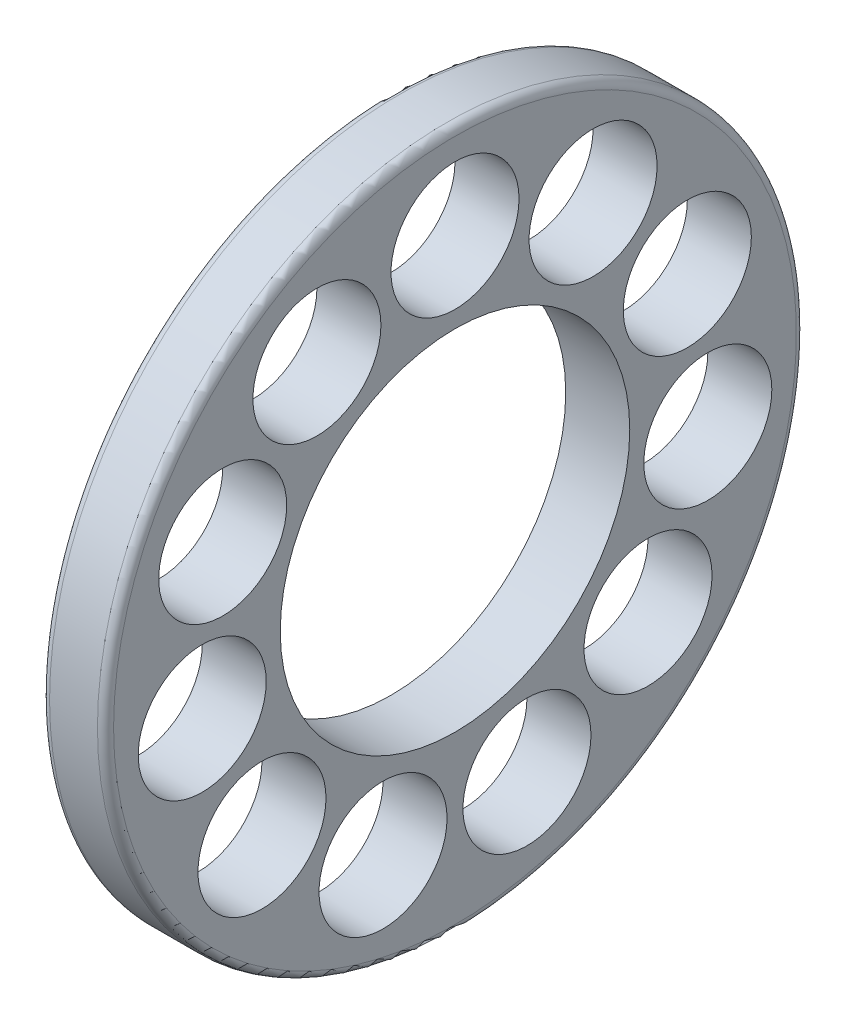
ISO-10303-21;
HEADER;
FILE_DESCRIPTION(('STEP AP214'),'2;1');
FILE_NAME('part.step','',(''),(''),'','','');
FILE_SCHEMA(('AUTOMOTIVE_DESIGN { 1 0 10303 214 1 1 1 1 }'));
ENDSEC;
DATA;
#1=APPLICATION_CONTEXT('core data for automotive mechanical design processes');
#2=APPLICATION_PROTOCOL_DEFINITION('international standard','automotive_design',2000,#1);
#3=PRODUCT_CONTEXT('',#1,'mechanical');
#4=PRODUCT('Part','Part','',(#3));
#5=PRODUCT_RELATED_PRODUCT_CATEGORY('part','',(#4));
#6=PRODUCT_DEFINITION_FORMATION('','',#4);
#7=PRODUCT_DEFINITION_CONTEXT('part definition',#1,'design');
#8=PRODUCT_DEFINITION('design','',#6,#7);
#9=PRODUCT_DEFINITION_SHAPE('','',#8);
#10=(LENGTH_UNIT() NAMED_UNIT(*) SI_UNIT(.MILLI.,.METRE.));
#11=(NAMED_UNIT(*) PLANE_ANGLE_UNIT() SI_UNIT($,.RADIAN.));
#12=(NAMED_UNIT(*) SI_UNIT($,.STERADIAN.) SOLID_ANGLE_UNIT());
#13=UNCERTAINTY_MEASURE_WITH_UNIT(LENGTH_MEASURE(1.E-05),#10,'distance_accuracy_value','');
#14=(GEOMETRIC_REPRESENTATION_CONTEXT(3) GLOBAL_UNCERTAINTY_ASSIGNED_CONTEXT((#13)) GLOBAL_UNIT_ASSIGNED_CONTEXT((#10,
#11,#12)) REPRESENTATION_CONTEXT('',''));
#15=CARTESIAN_POINT('',(0.,0.,0.));
#16=DIRECTION('',(0.,0.,1.));
#17=DIRECTION('',(1.,0.,0.));
#18=AXIS2_PLACEMENT_3D('',#15,#16,#17);
#19=CARTESIAN_POINT('',(3.3095,-12.9359195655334,-12.7));
#20=DIRECTION('',(-1.,0.,0.));
#21=DIRECTION('',(0.,0.,1.));
#22=AXIS2_PLACEMENT_3D('',#19,#20,#21);
#23=PLANE('',#22);
#24=CARTESIAN_POINT('',(3.3095,0.,0.));
#25=DIRECTION('',(-1.,0.,0.));
#26=DIRECTION('',(0.,0.,-1.));
#27=AXIS2_PLACEMENT_3D('',#24,#25,#26);
#28=CIRCLE('',#27,12.7);
#29=CARTESIAN_POINT('',(3.3095,0.,-12.7));
#30=VERTEX_POINT('',#29);
#31=EDGE_CURVE('E103',#30,#30,#28,.F.);
#32=ORIENTED_EDGE('',*,*,#31,.F.);
#33=EDGE_LOOP('',(#32));
#34=FACE_BOUND('',#33,.T.);
#35=CARTESIAN_POINT('',(3.3095,0.,0.));
#36=DIRECTION('',(1.,0.,0.));
#37=DIRECTION('',(0.,0.,1.));
#38=AXIS2_PLACEMENT_3D('',#35,#36,#37);
#39=CIRCLE('',#38,6.5);
#40=CARTESIAN_POINT('',(3.3095,0.,6.5));
#41=VERTEX_POINT('',#40);
#42=EDGE_CURVE('E100',#41,#41,#39,.T.);
#43=ORIENTED_EDGE('',*,*,#42,.T.);
#44=EDGE_LOOP('',(#43));
#45=FACE_BOUND('',#44,.T.);
#46=CARTESIAN_POINT('',(3.3095,3.9464426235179,8.6415039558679));
#47=DIRECTION('',(1.,0.,0.));
#48=DIRECTION('',(0.,0.,1.));
#49=AXIS2_PLACEMENT_3D('',#46,#47,#48);
#50=CIRCLE('',#49,2.381);
#51=CARTESIAN_POINT('',(3.3095,3.9464426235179,11.0225039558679));
#52=VERTEX_POINT('',#51);
#53=EDGE_CURVE('E97',#52,#52,#50,.T.);
#54=ORIENTED_EDGE('',*,*,#53,.T.);
#55=EDGE_LOOP('',(#54));
#56=FACE_BOUND('',#55,.T.);
#57=CARTESIAN_POINT('',(3.3095,-1.3519909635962,9.4033036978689));
#58=DIRECTION('',(1.,0.,0.));
#59=DIRECTION('',(0.,0.,1.));
#60=AXIS2_PLACEMENT_3D('',#57,#58,#59);
#61=CIRCLE('',#60,2.381);
#62=CARTESIAN_POINT('',(3.3095,-1.3519909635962,11.7843036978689));
#63=VERTEX_POINT('',#62);
#64=EDGE_CURVE('E94',#63,#63,#61,.T.);
#65=ORIENTED_EDGE('',*,*,#64,.T.);
#66=EDGE_LOOP('',(#65));
#67=FACE_BOUND('',#66,.T.);
#68=CARTESIAN_POINT('',(3.3095,-9.1151832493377,2.6764592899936));
#69=DIRECTION('',(1.,0.,0.));
#70=DIRECTION('',(0.,0.,1.));
#71=AXIS2_PLACEMENT_3D('',#68,#69,#70);
#72=CIRCLE('',#71,2.381);
#73=CARTESIAN_POINT('',(3.3095,-9.1151832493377,5.0574592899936));
#74=VERTEX_POINT('',#73);
#75=EDGE_CURVE('E91',#74,#74,#72,.T.);
#76=ORIENTED_EDGE('',*,*,#75,.T.);
#77=EDGE_LOOP('',(#76));
#78=FACE_BOUND('',#77,.T.);
#79=CARTESIAN_POINT('',(3.3095,-6.2211769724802,7.1796209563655));
#80=DIRECTION('',(1.,0.,0.));
#81=DIRECTION('',(0.,0.,1.));
#82=AXIS2_PLACEMENT_3D('',#79,#80,#81);
#83=CIRCLE('',#82,2.381);
#84=CARTESIAN_POINT('',(3.3095,-6.2211769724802,9.5606209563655));
#85=VERTEX_POINT('',#84);
#86=EDGE_CURVE('E88',#85,#85,#83,.T.);
#87=ORIENTED_EDGE('',*,*,#86,.T.);
#88=EDGE_LOOP('',(#87));
#89=FACE_BOUND('',#88,.T.);
#90=CARTESIAN_POINT('',(3.3095,-6.2211769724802,-7.1796209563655));
#91=DIRECTION('',(1.,0.,0.));
#92=DIRECTION('',(0.,0.,1.));
#93=AXIS2_PLACEMENT_3D('',#90,#91,#92);
#94=CIRCLE('',#93,2.381);
#95=CARTESIAN_POINT('',(3.3095,-6.2211769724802,-4.7986209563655));
#96=VERTEX_POINT('',#95);
#97=EDGE_CURVE('E85',#96,#96,#94,.T.);
#98=ORIENTED_EDGE('',*,*,#97,.T.);
#99=EDGE_LOOP('',(#98));
#100=FACE_BOUND('',#99,.T.);
#101=CARTESIAN_POINT('',(3.3095,-9.1151832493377,-2.6764592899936));
#102=DIRECTION('',(1.,0.,0.));
#103=DIRECTION('',(0.,0.,1.));
#104=AXIS2_PLACEMENT_3D('',#101,#102,#103);
#105=CIRCLE('',#104,2.381);
#106=CARTESIAN_POINT('',(3.3095,-9.1151832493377,-0.2954592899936));
#107=VERTEX_POINT('',#106);
#108=EDGE_CURVE('E82',#107,#107,#105,.T.);
#109=ORIENTED_EDGE('',*,*,#108,.T.);
#110=EDGE_LOOP('',(#109));
#111=FACE_BOUND('',#110,.T.);
#112=CARTESIAN_POINT('',(3.3095,-1.3519909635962,-9.4033036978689));
#113=DIRECTION('',(1.,0.,0.));
#114=DIRECTION('',(0.,0.,1.));
#115=AXIS2_PLACEMENT_3D('',#112,#113,#114);
#116=CIRCLE('',#115,2.381);
#117=CARTESIAN_POINT('',(3.3095,-1.3519909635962,-7.0223036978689));
#118=VERTEX_POINT('',#117);
#119=EDGE_CURVE('E79',#118,#118,#116,.T.);
#120=ORIENTED_EDGE('',*,*,#119,.T.);
#121=EDGE_LOOP('',(#120));
#122=FACE_BOUND('',#121,.T.);
#123=CARTESIAN_POINT('',(3.3095,3.9464426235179,-8.6415039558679));
#124=DIRECTION('',(1.,0.,0.));
#125=DIRECTION('',(0.,0.,1.));
#126=AXIS2_PLACEMENT_3D('',#123,#124,#125);
#127=CIRCLE('',#126,2.381);
#128=CARTESIAN_POINT('',(3.3095,3.9464426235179,-6.2605039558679));
#129=VERTEX_POINT('',#128);
#130=EDGE_CURVE('E76',#129,#129,#127,.T.);
#131=ORIENTED_EDGE('',*,*,#130,.T.);
#132=EDGE_LOOP('',(#131));
#133=FACE_BOUND('',#132,.T.);
#134=CARTESIAN_POINT('',(3.3095,7.9919085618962,-5.1360877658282));
#135=DIRECTION('',(1.,0.,0.));
#136=DIRECTION('',(0.,0.,1.));
#137=AXIS2_PLACEMENT_3D('',#134,#135,#136);
#138=CIRCLE('',#137,2.381);
#139=CARTESIAN_POINT('',(3.3095,7.9919085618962,-2.7550877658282));
#140=VERTEX_POINT('',#139);
#141=EDGE_CURVE('E73',#140,#140,#138,.T.);
#142=ORIENTED_EDGE('',*,*,#141,.T.);
#143=EDGE_LOOP('',(#142));
#144=FACE_BOUND('',#143,.T.);
#145=CARTESIAN_POINT('',(3.3095,7.9919085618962,5.1360877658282));
#146=DIRECTION('',(1.,0.,0.));
#147=DIRECTION('',(0.,0.,1.));
#148=AXIS2_PLACEMENT_3D('',#145,#146,#147);
#149=CIRCLE('',#148,2.381);
#150=CARTESIAN_POINT('',(3.3095,7.9919085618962,7.5170877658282));
#151=VERTEX_POINT('',#150);
#152=EDGE_CURVE('E70',#151,#151,#149,.T.);
#153=ORIENTED_EDGE('',*,*,#152,.T.);
#154=EDGE_LOOP('',(#153));
#155=FACE_BOUND('',#154,.T.);
#156=CARTESIAN_POINT('',(3.3095,9.5,0.));
#157=DIRECTION('',(1.,0.,0.));
#158=DIRECTION('',(0.,0.,1.));
#159=AXIS2_PLACEMENT_3D('',#156,#157,#158);
#160=CIRCLE('',#159,2.381);
#161=CARTESIAN_POINT('',(3.3095,9.5,2.381));
#162=VERTEX_POINT('',#161);
#163=EDGE_CURVE('E67',#162,#162,#160,.T.);
#164=ORIENTED_EDGE('',*,*,#163,.T.);
#165=EDGE_LOOP('',(#164));
#166=FACE_BOUND('',#165,.T.);
#167=ADVANCED_FACE('F14',(#34,#45,#56,#67,#78,#89,#100,#111,#122,#133,#144,#155,#166),#23,.T.);
#168=CARTESIAN_POINT('',(5.6905,-12.9359195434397,12.7));
#169=DIRECTION('',(1.,0.,0.));
#170=DIRECTION('',(0.,0.,-1.));
#171=AXIS2_PLACEMENT_3D('',#168,#169,#170);
#172=PLANE('',#171);
#173=CARTESIAN_POINT('',(5.6905,0.,0.));
#174=DIRECTION('',(1.,0.,0.));
#175=DIRECTION('',(0.,-1.168417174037E-09,1.));
#176=AXIS2_PLACEMENT_3D('',#173,#174,#175);
#177=CIRCLE('',#176,12.700000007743);
#178=CARTESIAN_POINT('',(5.6905,-1.48388981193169E-08,12.700000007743));
#179=VERTEX_POINT('',#178);
#180=EDGE_CURVE('E64',#179,#179,#177,.T.);
#181=ORIENTED_EDGE('',*,*,#180,.T.);
#182=EDGE_LOOP('',(#181));
#183=FACE_BOUND('',#182,.T.);
#184=CARTESIAN_POINT('',(5.6905,0.,0.));
#185=DIRECTION('',(-1.,0.,0.));
#186=DIRECTION('',(0.,0.,-1.));
#187=AXIS2_PLACEMENT_3D('',#184,#185,#186);
#188=CIRCLE('',#187,6.5);
#189=CARTESIAN_POINT('',(5.6905,0.,-6.5));
#190=VERTEX_POINT('',#189);
#191=EDGE_CURVE('E61',#190,#190,#188,.F.);
#192=ORIENTED_EDGE('',*,*,#191,.F.);
#193=EDGE_LOOP('',(#192));
#194=FACE_BOUND('',#193,.T.);
#195=CARTESIAN_POINT('',(5.6905,3.9464426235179,8.6415039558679));
#196=DIRECTION('',(-1.,0.,0.));
#197=DIRECTION('',(0.,0.,-1.));
#198=AXIS2_PLACEMENT_3D('',#195,#196,#197);
#199=CIRCLE('',#198,2.381);
#200=CARTESIAN_POINT('',(5.6905,3.9464426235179,6.2605039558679));
#201=VERTEX_POINT('',#200);
#202=EDGE_CURVE('E58',#201,#201,#199,.T.);
#203=ORIENTED_EDGE('',*,*,#202,.T.);
#204=EDGE_LOOP('',(#203));
#205=FACE_BOUND('',#204,.T.);
#206=CARTESIAN_POINT('',(5.6905,-1.3519909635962,9.4033036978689));
#207=DIRECTION('',(-1.,0.,0.));
#208=DIRECTION('',(0.,0.,-1.));
#209=AXIS2_PLACEMENT_3D('',#206,#207,#208);
#210=CIRCLE('',#209,2.381);
#211=CARTESIAN_POINT('',(5.6905,-1.3519909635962,7.0223036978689));
#212=VERTEX_POINT('',#211);
#213=EDGE_CURVE('E55',#212,#212,#210,.T.);
#214=ORIENTED_EDGE('',*,*,#213,.T.);
#215=EDGE_LOOP('',(#214));
#216=FACE_BOUND('',#215,.T.);
#217=CARTESIAN_POINT('',(5.6905,-9.1151832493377,2.6764592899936));
#218=DIRECTION('',(-1.,0.,0.));
#219=DIRECTION('',(0.,0.,-1.));
#220=AXIS2_PLACEMENT_3D('',#217,#218,#219);
#221=CIRCLE('',#220,2.381);
#222=CARTESIAN_POINT('',(5.6905,-9.1151832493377,0.2954592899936));
#223=VERTEX_POINT('',#222);
#224=EDGE_CURVE('E52',#223,#223,#221,.T.);
#225=ORIENTED_EDGE('',*,*,#224,.T.);
#226=EDGE_LOOP('',(#225));
#227=FACE_BOUND('',#226,.T.);
#228=CARTESIAN_POINT('',(5.6905,-6.2211769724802,7.1796209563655));
#229=DIRECTION('',(-1.,0.,0.));
#230=DIRECTION('',(0.,0.,-1.));
#231=AXIS2_PLACEMENT_3D('',#228,#229,#230);
#232=CIRCLE('',#231,2.381);
#233=CARTESIAN_POINT('',(5.6905,-6.2211769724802,4.7986209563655));
#234=VERTEX_POINT('',#233);
#235=EDGE_CURVE('E49',#234,#234,#232,.T.);
#236=ORIENTED_EDGE('',*,*,#235,.T.);
#237=EDGE_LOOP('',(#236));
#238=FACE_BOUND('',#237,.T.);
#239=CARTESIAN_POINT('',(5.6905,-6.2211769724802,-7.1796209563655));
#240=DIRECTION('',(-1.,0.,0.));
#241=DIRECTION('',(0.,0.,-1.));
#242=AXIS2_PLACEMENT_3D('',#239,#240,#241);
#243=CIRCLE('',#242,2.381);
#244=CARTESIAN_POINT('',(5.6905,-6.2211769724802,-9.5606209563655));
#245=VERTEX_POINT('',#244);
#246=EDGE_CURVE('E46',#245,#245,#243,.T.);
#247=ORIENTED_EDGE('',*,*,#246,.T.);
#248=EDGE_LOOP('',(#247));
#249=FACE_BOUND('',#248,.T.);
#250=CARTESIAN_POINT('',(5.6905,-9.1151832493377,-2.6764592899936));
#251=DIRECTION('',(-1.,0.,0.));
#252=DIRECTION('',(0.,0.,-1.));
#253=AXIS2_PLACEMENT_3D('',#250,#251,#252);
#254=CIRCLE('',#253,2.381);
#255=CARTESIAN_POINT('',(5.6905,-9.1151832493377,-5.0574592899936));
#256=VERTEX_POINT('',#255);
#257=EDGE_CURVE('E43',#256,#256,#254,.T.);
#258=ORIENTED_EDGE('',*,*,#257,.T.);
#259=EDGE_LOOP('',(#258));
#260=FACE_BOUND('',#259,.T.);
#261=CARTESIAN_POINT('',(5.6905,-1.3519909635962,-9.4033036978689));
#262=DIRECTION('',(-1.,0.,0.));
#263=DIRECTION('',(0.,0.,-1.));
#264=AXIS2_PLACEMENT_3D('',#261,#262,#263);
#265=CIRCLE('',#264,2.381);
#266=CARTESIAN_POINT('',(5.6905,-1.3519909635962,-11.7843036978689));
#267=VERTEX_POINT('',#266);
#268=EDGE_CURVE('E40',#267,#267,#265,.T.);
#269=ORIENTED_EDGE('',*,*,#268,.T.);
#270=EDGE_LOOP('',(#269));
#271=FACE_BOUND('',#270,.T.);
#272=CARTESIAN_POINT('',(5.6905,3.9464426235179,-8.6415039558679));
#273=DIRECTION('',(-1.,0.,0.));
#274=DIRECTION('',(0.,0.,-1.));
#275=AXIS2_PLACEMENT_3D('',#272,#273,#274);
#276=CIRCLE('',#275,2.381);
#277=CARTESIAN_POINT('',(5.6905,3.9464426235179,-11.0225039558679));
#278=VERTEX_POINT('',#277);
#279=EDGE_CURVE('E37',#278,#278,#276,.T.);
#280=ORIENTED_EDGE('',*,*,#279,.T.);
#281=EDGE_LOOP('',(#280));
#282=FACE_BOUND('',#281,.T.);
#283=CARTESIAN_POINT('',(5.6905,7.9919085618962,-5.1360877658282));
#284=DIRECTION('',(-1.,0.,0.));
#285=DIRECTION('',(0.,-1.42053884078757E-07,-0.99999999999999));
#286=AXIS2_PLACEMENT_3D('',#283,#284,#285);
#287=CIRCLE('',#286,2.381);
#288=CARTESIAN_POINT('',(5.6905,7.9919082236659,-7.51708776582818));
#289=VERTEX_POINT('',#288);
#290=EDGE_CURVE('E34',#289,#289,#287,.T.);
#291=ORIENTED_EDGE('',*,*,#290,.T.);
#292=EDGE_LOOP('',(#291));
#293=FACE_BOUND('',#292,.T.);
#294=CARTESIAN_POINT('',(5.6905,7.9919085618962,5.1360877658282));
#295=DIRECTION('',(-1.,0.,0.));
#296=DIRECTION('',(0.,-1.42053884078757E-07,-0.99999999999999));
#297=AXIS2_PLACEMENT_3D('',#294,#295,#296);
#298=CIRCLE('',#297,2.381);
#299=CARTESIAN_POINT('',(5.6905,7.9919082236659,2.75508776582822));
#300=VERTEX_POINT('',#299);
#301=EDGE_CURVE('E29',#300,#300,#298,.T.);
#302=ORIENTED_EDGE('',*,*,#301,.T.);
#303=EDGE_LOOP('',(#302));
#304=FACE_BOUND('',#303,.T.);
#305=CARTESIAN_POINT('',(5.6905,9.5,0.));
#306=DIRECTION('',(-1.,0.,0.));
#307=DIRECTION('',(0.,-1.42053886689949E-07,-0.99999999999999));
#308=AXIS2_PLACEMENT_3D('',#305,#306,#307);
#309=CIRCLE('',#308,2.381);
#310=CARTESIAN_POINT('',(5.6905,9.49999966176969,-2.38099999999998));
#311=VERTEX_POINT('',#310);
#312=EDGE_CURVE('E25',#311,#311,#309,.T.);
#313=ORIENTED_EDGE('',*,*,#312,.T.);
#314=EDGE_LOOP('',(#313));
#315=FACE_BOUND('',#314,.T.);
#316=ADVANCED_FACE('F112',(#183,#194,#205,#216,#227,#238,#249,#260,#271,#282,#293,#304,#315),
#172,.T.);
#317=CARTESIAN_POINT('',(3.60949999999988,0.,0.));
#318=DIRECTION('',(1.,0.,0.));
#319=DIRECTION('',(0.,1.92328053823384E-10,1.));
#320=AXIS2_PLACEMENT_3D('',#317,#318,#319);
#321=TOROIDAL_SURFACE('',#320,12.7000000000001,0.29999999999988);
#322=ORIENTED_EDGE('',*,*,#31,.T.);
#323=EDGE_LOOP('',(#322));
#324=FACE_BOUND('',#323,.T.);
#325=CARTESIAN_POINT('',(3.60949999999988,0.,0.));
#326=DIRECTION('',(-1.,0.,0.));
#327=DIRECTION('',(0.,0.,-1.));
#328=AXIS2_PLACEMENT_3D('',#325,#326,#327);
#329=CIRCLE('',#328,13.);
#330=CARTESIAN_POINT('',(3.60949999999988,0.,-13.));
#331=VERTEX_POINT('',#330);
#332=EDGE_CURVE('E21',#331,#331,#329,.F.);
#333=ORIENTED_EDGE('',*,*,#332,.F.);
#334=EDGE_LOOP('',(#333));
#335=FACE_BOUND('',#334,.T.);
#336=ADVANCED_FACE('F107',(#324,#335),#321,.T.);
#337=CARTESIAN_POINT('',(5.6905,0.,0.));
#338=DIRECTION('',(1.,0.,0.));
#339=DIRECTION('',(0.,0.,1.));
#340=AXIS2_PLACEMENT_3D('',#337,#338,#339);
#341=CYLINDRICAL_SURFACE('',#340,6.5);
#342=ORIENTED_EDGE('',*,*,#191,.T.);
#343=EDGE_LOOP('',(#342));
#344=FACE_BOUND('',#343,.T.);
#345=ORIENTED_EDGE('',*,*,#42,.F.);
#346=EDGE_LOOP('',(#345));
#347=FACE_BOUND('',#346,.T.);
#348=ADVANCED_FACE('F153',(#344,#347),#341,.F.);
#349=CARTESIAN_POINT('',(5.39050000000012,0.,0.));
#350=DIRECTION('',(1.,0.,0.));
#351=DIRECTION('',(0.,0.,1.));
#352=AXIS2_PLACEMENT_3D('',#349,#350,#351);
#353=TOROIDAL_SURFACE('',#352,12.7000000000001,0.29999999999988);
#354=CARTESIAN_POINT('',(5.39050000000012,0.,0.));
#355=DIRECTION('',(1.,0.,0.));
#356=DIRECTION('',(0.,0.,1.));
#357=AXIS2_PLACEMENT_3D('',#354,#355,#356);
#358=CIRCLE('',#357,13.);
#359=CARTESIAN_POINT('',(5.39050000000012,0.,13.));
#360=VERTEX_POINT('',#359);
#361=EDGE_CURVE('E9',#360,#360,#358,.T.);
#362=ORIENTED_EDGE('',*,*,#361,.T.);
#363=EDGE_LOOP('',(#362));
#364=FACE_BOUND('',#363,.T.);
#365=ORIENTED_EDGE('',*,*,#180,.F.);
#366=EDGE_LOOP('',(#365));
#367=FACE_BOUND('',#366,.T.);
#368=ADVANCED_FACE('F159',(#364,#367),#353,.T.);
#369=CARTESIAN_POINT('',(5.6905,0.,0.));
#370=DIRECTION('',(1.,0.,0.));
#371=DIRECTION('',(0.,1.92328053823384E-10,1.));
#372=AXIS2_PLACEMENT_3D('',#369,#370,#371);
#373=CYLINDRICAL_SURFACE('',#372,13.);
#374=ORIENTED_EDGE('',*,*,#332,.T.);
#375=EDGE_LOOP('',(#374));
#376=FACE_BOUND('',#375,.T.);
#377=ORIENTED_EDGE('',*,*,#361,.F.);
#378=EDGE_LOOP('',(#377));
#379=FACE_BOUND('',#378,.T.);
#380=ADVANCED_FACE('F142',(#376,#379),#373,.T.);
#381=CARTESIAN_POINT('',(9.,9.5,0.));
#382=DIRECTION('',(-1.,0.,0.));
#383=DIRECTION('',(0.,0.,-1.));
#384=AXIS2_PLACEMENT_3D('',#381,#382,#383);
#385=CYLINDRICAL_SURFACE('',#384,2.381);
#386=ORIENTED_EDGE('',*,*,#163,.F.);
#387=EDGE_LOOP('',(#386));
#388=FACE_BOUND('',#387,.T.);
#389=ORIENTED_EDGE('',*,*,#312,.F.);
#390=EDGE_LOOP('',(#389));
#391=FACE_BOUND('',#390,.T.);
#392=ADVANCED_FACE('F138',(#388,#391),#385,.F.);
#393=CARTESIAN_POINT('',(9.,7.9919085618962,5.1360877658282));
#394=DIRECTION('',(-1.,0.,0.));
#395=DIRECTION('',(0.,0.,-1.));
#396=AXIS2_PLACEMENT_3D('',#393,#394,#395);
#397=CYLINDRICAL_SURFACE('',#396,2.381);
#398=ORIENTED_EDGE('',*,*,#152,.F.);
#399=EDGE_LOOP('',(#398));
#400=FACE_BOUND('',#399,.T.);
#401=ORIENTED_EDGE('',*,*,#301,.F.);
#402=EDGE_LOOP('',(#401));
#403=FACE_BOUND('',#402,.T.);
#404=ADVANCED_FACE('F141',(#400,#403),#397,.F.);
#405=CARTESIAN_POINT('',(9.,7.9919085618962,-5.1360877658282));
#406=DIRECTION('',(-1.,0.,0.));
#407=DIRECTION('',(0.,0.,-1.));
#408=AXIS2_PLACEMENT_3D('',#405,#406,#407);
#409=CYLINDRICAL_SURFACE('',#408,2.381);
#410=ORIENTED_EDGE('',*,*,#141,.F.);
#411=EDGE_LOOP('',(#410));
#412=FACE_BOUND('',#411,.T.);
#413=ORIENTED_EDGE('',*,*,#290,.F.);
#414=EDGE_LOOP('',(#413));
#415=FACE_BOUND('',#414,.T.);
#416=ADVANCED_FACE('F167',(#412,#415),#409,.F.);
#417=CARTESIAN_POINT('',(9.,3.9464426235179,-8.6415039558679));
#418=DIRECTION('',(-1.,0.,0.));
#419=DIRECTION('',(0.,0.,-1.));
#420=AXIS2_PLACEMENT_3D('',#417,#418,#419);
#421=CYLINDRICAL_SURFACE('',#420,2.381);
#422=ORIENTED_EDGE('',*,*,#130,.F.);
#423=EDGE_LOOP('',(#422));
#424=FACE_BOUND('',#423,.T.);
#425=ORIENTED_EDGE('',*,*,#279,.F.);
#426=EDGE_LOOP('',(#425));
#427=FACE_BOUND('',#426,.T.);
#428=ADVANCED_FACE('F171',(#424,#427),#421,.F.);
#429=CARTESIAN_POINT('',(9.,-1.3519909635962,-9.4033036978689));
#430=DIRECTION('',(-1.,0.,0.));
#431=DIRECTION('',(0.,0.,-1.));
#432=AXIS2_PLACEMENT_3D('',#429,#430,#431);
#433=CYLINDRICAL_SURFACE('',#432,2.381);
#434=ORIENTED_EDGE('',*,*,#119,.F.);
#435=EDGE_LOOP('',(#434));
#436=FACE_BOUND('',#435,.T.);
#437=ORIENTED_EDGE('',*,*,#268,.F.);
#438=EDGE_LOOP('',(#437));
#439=FACE_BOUND('',#438,.T.);
#440=ADVANCED_FACE('F175',(#436,#439),#433,.F.);
#441=CARTESIAN_POINT('',(9.,-9.1151832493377,-2.6764592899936));
#442=DIRECTION('',(-1.,0.,0.));
#443=DIRECTION('',(0.,0.,-1.));
#444=AXIS2_PLACEMENT_3D('',#441,#442,#443);
#445=CYLINDRICAL_SURFACE('',#444,2.381);
#446=ORIENTED_EDGE('',*,*,#108,.F.);
#447=EDGE_LOOP('',(#446));
#448=FACE_BOUND('',#447,.T.);
#449=ORIENTED_EDGE('',*,*,#257,.F.);
#450=EDGE_LOOP('',(#449));
#451=FACE_BOUND('',#450,.T.);
#452=ADVANCED_FACE('F179',(#448,#451),#445,.F.);
#453=CARTESIAN_POINT('',(9.,-6.2211769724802,-7.1796209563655));
#454=DIRECTION('',(-1.,0.,0.));
#455=DIRECTION('',(0.,1.42053884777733E-07,-0.99999999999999));
#456=AXIS2_PLACEMENT_3D('',#453,#454,#455);
#457=CYLINDRICAL_SURFACE('',#456,2.381);
#458=ORIENTED_EDGE('',*,*,#97,.F.);
#459=EDGE_LOOP('',(#458));
#460=FACE_BOUND('',#459,.T.);
#461=ORIENTED_EDGE('',*,*,#246,.F.);
#462=EDGE_LOOP('',(#461));
#463=FACE_BOUND('',#462,.T.);
#464=ADVANCED_FACE('F183',(#460,#463),#457,.F.);
#465=CARTESIAN_POINT('',(9.,-6.2211769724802,7.1796209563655));
#466=DIRECTION('',(-1.,0.,0.));
#467=DIRECTION('',(0.,1.4205392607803E-07,-0.99999999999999));
#468=AXIS2_PLACEMENT_3D('',#465,#466,#467);
#469=CYLINDRICAL_SURFACE('',#468,2.381);
#470=ORIENTED_EDGE('',*,*,#86,.F.);
#471=EDGE_LOOP('',(#470));
#472=FACE_BOUND('',#471,.T.);
#473=ORIENTED_EDGE('',*,*,#235,.F.);
#474=EDGE_LOOP('',(#473));
#475=FACE_BOUND('',#474,.T.);
#476=ADVANCED_FACE('F187',(#472,#475),#469,.F.);
#477=CARTESIAN_POINT('',(9.,-9.1151832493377,2.6764592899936));
#478=DIRECTION('',(-1.,0.,0.));
#479=DIRECTION('',(0.,0.,-1.));
#480=AXIS2_PLACEMENT_3D('',#477,#478,#479);
#481=CYLINDRICAL_SURFACE('',#480,2.381);
#482=ORIENTED_EDGE('',*,*,#75,.F.);
#483=EDGE_LOOP('',(#482));
#484=FACE_BOUND('',#483,.T.);
#485=ORIENTED_EDGE('',*,*,#224,.F.);
#486=EDGE_LOOP('',(#485));
#487=FACE_BOUND('',#486,.T.);
#488=ADVANCED_FACE('F191',(#484,#487),#481,.F.);
#489=CARTESIAN_POINT('',(9.,-1.3519909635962,9.4033036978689));
#490=DIRECTION('',(-1.,0.,0.));
#491=DIRECTION('',(0.,0.,-1.));
#492=AXIS2_PLACEMENT_3D('',#489,#490,#491);
#493=CYLINDRICAL_SURFACE('',#492,2.381);
#494=ORIENTED_EDGE('',*,*,#64,.F.);
#495=EDGE_LOOP('',(#494));
#496=FACE_BOUND('',#495,.T.);
#497=ORIENTED_EDGE('',*,*,#213,.F.);
#498=EDGE_LOOP('',(#497));
#499=FACE_BOUND('',#498,.T.);
#500=ADVANCED_FACE('F194',(#496,#499),#493,.F.);
#501=CARTESIAN_POINT('',(9.,3.9464426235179,8.6415039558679));
#502=DIRECTION('',(-1.,0.,0.));
#503=DIRECTION('',(0.,0.,-1.));
#504=AXIS2_PLACEMENT_3D('',#501,#502,#503);
#505=CYLINDRICAL_SURFACE('',#504,2.381);
#506=ORIENTED_EDGE('',*,*,#53,.F.);
#507=EDGE_LOOP('',(#506));
#508=FACE_BOUND('',#507,.T.);
#509=ORIENTED_EDGE('',*,*,#202,.F.);
#510=EDGE_LOOP('',(#509));
#511=FACE_BOUND('',#510,.T.);
#512=ADVANCED_FACE('F16',(#508,#511),#505,.F.);
#513=CLOSED_SHELL('',(#167,#316,#336,#348,#368,#380,#392,#404,#416,#428,#440,#452,#464,#476,
#488,#500,#512));
#514=MANIFOLD_SOLID_BREP('B1',#513);
#515=ADVANCED_BREP_SHAPE_REPRESENTATION('',(#18,#514),#14);
#516=SHAPE_DEFINITION_REPRESENTATION(#9,#515);
ENDSEC;
END-ISO-10303-21;
